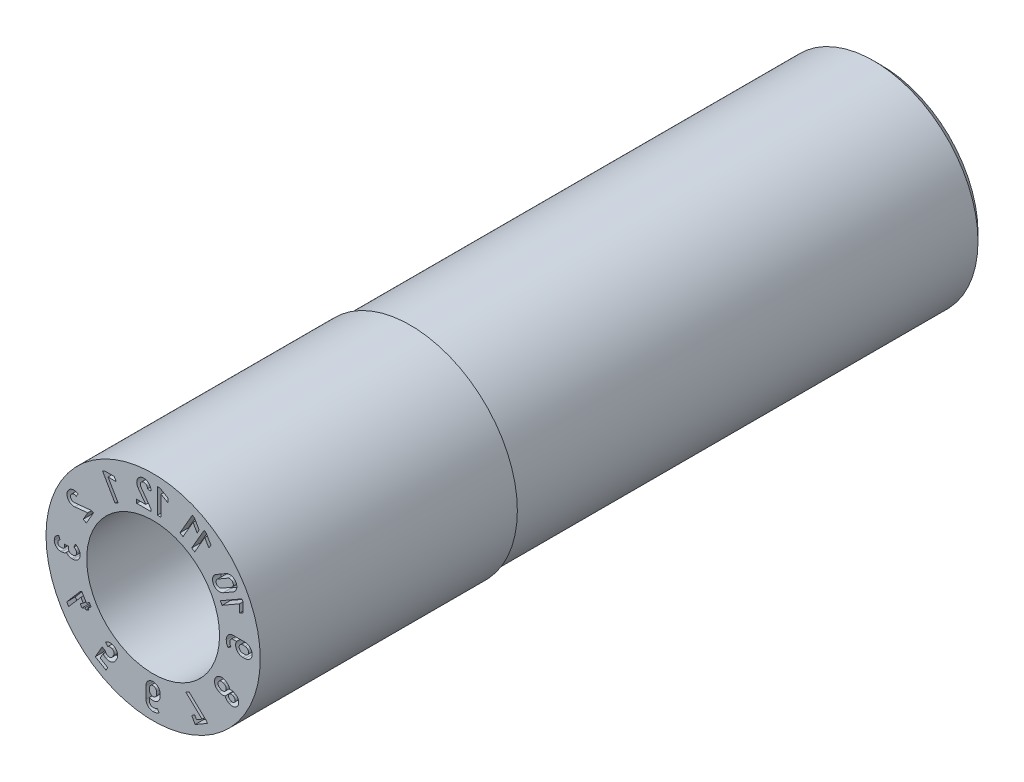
from build123d import *

# Parameters (mm, degrees)
SKETCH4_W          = 11
SKETCH4_H          = 1
CUT_EXTRUDE1_DEPTH = 0.2
CUT_EXTRUDE2_DEPTH = 1.4


with BuildPart() as part:
    # Sketch1 → Revolve1 (revolve)
    with BuildSketch(Plane(origin=(0, 0, 0), x_dir=(0, 0, -1), z_dir=(1, 0, 0)), mode=Mode.PRIVATE) as revolve1_sk:
        Polygon((0, 2.5), (0, 1.55), (2.8, 1.55), (2.8, 0.8), (14, 0.8), (14, 1.5), (17, 1.5), (17, 2.25), (16.75, 2.5), align=None)
    revolve(revolve1_sk.sketch.rotate(Axis((0, 0, 3.797909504), (0, 0, -1)), 90), axis=Axis((0, 0, 3.797909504), (0, 0, -1)))

    # Sketch4 → Cut-Revolve1 (revolve, cut)
    with BuildSketch(Plane(origin=(0, 0, 0), x_dir=(0, 0, -1), z_dir=(1, 0, 0)), mode=Mode.PRIVATE) as cut_revolve1_sk:
        with Locations((11.5, 2.935)):
            Rectangle(SKETCH4_W, SKETCH4_H)
    revolve(cut_revolve1_sk.sketch.rotate(Axis((0, 0, 0), (0, 0, -1)), 90), axis=Axis((0, 0, 0), (0, 0, -1)), mode=Mode.SUBTRACT)

    # Sketch2 → Cut-Extrude1 (cut)
    # profile 1 of 15: a face of its own
    with BuildSketch(Plane.XY):
        Polygon((1.189785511, 1.946416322), (1.236985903, 1.919165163), (1.349145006, 1.725678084), (1.30140042, 1.642982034), (1.205586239, 1.80821378), (0.97169688, 1.403105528), (0.900002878, 1.444498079), align=None)
    # profile 2 of 15: a face of its own
    with BuildSketch(Plane.XY):
        Polygon((0.915385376, 2.116117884), (0.962585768, 2.088866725), (1.074744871, 1.895379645), (1.027000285, 1.812683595), (0.931186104, 1.977915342), (0.697296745, 1.572807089), (0.625602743, 1.61419964), align=None)
    # profile 3 of 15: a face of its own
    with BuildSketch(Plane.XY):
        with BuildLine():
            Line((2.144767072, 0.163392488), (1.871541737, 0.163346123))
            ThreePointArc((1.871541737, 0.163346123), (1.754462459, 0.114843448), (1.705943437, -0.002229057))
            ThreePointArc((1.705943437, -0.002229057), (1.715873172, -0.075274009), (1.744983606, -0.142999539))
            Line((1.744983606, -0.142999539), (1.816077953, -0.100273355))
            ThreePointArc((1.816077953, -0.100273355), (1.793827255, -0.050339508), (1.7889851, 0.004112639))
            ThreePointArc((1.7889851, 0.004112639), (1.815273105, 0.058513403), (1.871527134, 0.080558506))
            Line((1.871527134, 0.080558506), (1.947523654, 0.080551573))
            ThreePointArc((1.947523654, 0.080551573), (1.94718892, -0.085293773), (2.090950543, -0.167982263))
            Line((2.090950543, -0.167982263), (2.144654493, -0.167796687))
            ThreePointArc((2.144654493, -0.167796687), (2.31030537, -0.002258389), (2.144767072, 0.163392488))
        make_face()
        with BuildLine():
            Line((2.144767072, 0.080561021), (2.090960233, 0.080561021))
            ThreePointArc((2.090960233, 0.080561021), (2.00816354, -0.002238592), (2.090966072, -0.085032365))
            Line((2.090966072, -0.085032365), (2.144761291, -0.085032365))
            ThreePointArc((2.144761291, -0.085032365), (2.227560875, -0.002238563), (2.144767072, 0.080561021))
        make_face(mode=Mode.SUBTRACT)
    # profile 4 of 15: a face of its own
    with BuildSketch(Plane.XY):
        Polygon((0.763515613, -1.538242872), (0.838361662, -1.495030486), (1.248532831, -1.881560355), (1.268400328, -1.91597187), (0.981584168, -2.081565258), (0.898787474, -1.938157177), (0.970501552, -1.896753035), (1.011894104, -1.968447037), (1.140947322, -1.893938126), align=None)
    # profile 5 of 15: a face of its own
    with BuildSketch(Plane.XY):
        with BuildLine():
            Line((1.705307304, -0.85661671), (1.680233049, -0.842113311))
            ThreePointArc((1.680233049, -0.842113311), (1.45391345, -0.902658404), (1.514639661, -1.128929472))
            Line((1.514639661, -1.128929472), (1.539717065, -1.143407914))
            ThreePointArc((1.539717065, -1.143407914), (1.608311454, -1.164983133), (1.679583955, -1.155448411))
            ThreePointArc((1.679583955, -1.155448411), (1.705355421, -1.207044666), (1.748767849, -1.24501443))
            Line((1.748767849, -1.24501443), (1.773870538, -1.259483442))
            ThreePointArc((1.773870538, -1.259483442), (1.977393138, -1.20494098), (1.922850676, -1.00141838))
            Line((1.922850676, -1.00141838), (1.897809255, -0.986853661))
            ThreePointArc((1.897809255, -0.986853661), (1.843247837, -0.968135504), (1.785676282, -0.971717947))
            ThreePointArc((1.785676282, -0.971717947), (1.758292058, -0.905229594), (1.705307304, -0.85661671))
        make_face()
        with BuildLine():
            Line((1.790155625, -1.173326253), (1.81525798, -1.187792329))
            ThreePointArc((1.81525798, -1.187792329), (1.905733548, -1.163549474), (1.881490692, -1.073073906))
            Line((1.881490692, -1.073073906), (1.856411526, -1.058567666))
            ThreePointArc((1.856411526, -1.058567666), (1.765812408, -1.082765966), (1.790155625, -1.173326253))
        make_face(mode=Mode.SUBTRACT)
        with BuildLine():
            Line((1.55601773, -1.057232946), (1.581132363, -1.071732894))
            ThreePointArc((1.581132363, -1.071732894), (1.694215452, -1.04141854), (1.663901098, -0.928335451))
            Line((1.663901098, -0.928335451), (1.638826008, -0.913804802))
            ThreePointArc((1.638826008, -0.913804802), (1.525737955, -0.944132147), (1.55601773, -1.057232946))
        make_face(mode=Mode.SUBTRACT)
    # profile 6 of 15: a face of its own
    with BuildSketch(Plane.XY):
        Polygon((2.071005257, 1.002372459), (2.098256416, 0.955172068), (2.098645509, 0.73152779), (2.015949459, 0.683783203), (2.015587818, 0.874785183), (1.610479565, 0.640895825), (1.569087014, 0.712589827), align=None)
    # profile 7 of 15: a face of its own
    with BuildSketch(Plane.XY):
        with BuildLine():
            Line((1.705388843, 1.33047051), (1.468770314, 1.193858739))
            ThreePointArc((1.468770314, 1.193858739), (1.408137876, 0.967618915), (1.634381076, 0.906999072))
            Line((1.634381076, 0.906999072), (1.871005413, 1.043614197))
            ThreePointArc((1.871005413, 1.043614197), (1.931625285, 1.269850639), (1.705388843, 1.33047051))
        make_face()
        with BuildLine():
            Line((1.592976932, 0.978713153), (1.829601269, 1.115328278))
            ThreePointArc((1.829601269, 1.115328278), (1.85990272, 1.228414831), (1.746816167, 1.258716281))
            Line((1.746816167, 1.258716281), (1.510163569, 1.122138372))
            ThreePointArc((1.510163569, 1.122138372), (1.4798551, 1.009017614), (1.592976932, 0.978713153))
        make_face(mode=Mode.SUBTRACT)
    # profile 8 of 15: a face of its own
    with BuildSketch(Plane.XY):
        Polygon((0.101613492, 2.286608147), (0.156115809, 2.286608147), (0.349991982, 2.175122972), (0.349991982, 2.079633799), (0.184398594, 2.174821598), (0.184398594, 1.707042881), (0.101613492, 1.707042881), align=None)
    # profile 9 of 15: a face of its own
    with BuildSketch(Plane.XY):
        with BuildLine():
            Line((-0.382458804, 1.705773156), (-0.051272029, 1.705773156))
            Line((-0.051272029, 1.705773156), (-0.051272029, 1.760530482))
            Line((-0.051272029, 1.760530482), (-0.284094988, 2.083765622))
            ThreePointArc((-0.284094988, 2.083765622), (-0.236321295, 2.212681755), (-0.135007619, 2.119745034))
            Line((-0.135007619, 2.119745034), (-0.05173191, 2.119742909))
            ThreePointArc((-0.05173191, 2.119742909), (-0.261870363, 2.291530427), (-0.35138769, 2.03529661))
            Line((-0.35138769, 2.03529661), (-0.171311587, 1.788581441))
            Line((-0.171311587, 1.788581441), (-0.382458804, 1.788581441))
            Line((-0.382458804, 1.788581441), (-0.382458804, 1.705773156))
        make_face()
    # profile 10 of 15: a face of its own
    with BuildSketch(Plane.XY):
        Polygon((-1.178901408, 1.959132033), (-1.131701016, 1.986383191), (-0.908056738, 1.986772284), (-0.860312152, 1.904076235), (-1.051314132, 1.903714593), (-0.817424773, 1.498606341), (-0.889118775, 1.457213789), align=None)
    # profile 11 of 15: a face of its own
    with BuildSketch(Plane.XY):
        with BuildLine():
            Line((0.163306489, -1.871711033), (0.163492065, -1.925414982))
            ThreePointArc((0.163492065, -1.925414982), (0.080803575, -2.069176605), (-0.085041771, -2.068841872))
            Line((-0.085041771, -2.068841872), (-0.085048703, -2.144838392))
            ThreePointArc((-0.085048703, -2.144838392), (-0.0630036, -2.201092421), (-0.008602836, -2.227380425))
            ThreePointArc((-0.008602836, -2.227380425), (0.045845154, -2.222539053), (0.09577566, -2.200291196))
            Line((0.09577566, -2.200291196), (0.138511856, -2.271391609))
            ThreePointArc((0.138511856, -2.271391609), (0.070786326, -2.300502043), (-0.002258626, -2.310431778))
            ThreePointArc((-0.002258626, -2.310431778), (-0.11933113, -2.261912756), (-0.167833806, -2.144833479))
            Line((-0.167833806, -2.144833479), (-0.167880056, -1.871597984))
            ThreePointArc((-0.167880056, -1.871597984), (-0.002230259, -1.706061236), (0.163306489, -1.871711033))
        make_face()
        with BuildLine():
            Line((-0.085048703, -1.871608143), (-0.085048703, -1.925414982))
            ThreePointArc((-0.085048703, -1.925414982), (-0.002249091, -2.008211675), (0.080544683, -1.925409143))
            Line((0.080544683, -1.925409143), (0.080544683, -1.871613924))
            ThreePointArc((0.080544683, -1.871613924), (-0.00224912, -1.788814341), (-0.085048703, -1.871608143))
        make_face(mode=Mode.SUBTRACT)
    # profile 12 of 15: a face of its own
    with BuildSketch(Plane.XY):
        with BuildLine():
            Line((-0.850418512, -1.674551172), (-0.877373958, -1.721100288))
            ThreePointArc((-0.877373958, -1.721100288), (-0.977919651, -1.798165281), (-1.103534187, -1.781750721))
            ThreePointArc((-1.103534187, -1.781750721), (-1.137985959, -1.756862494), (-1.166573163, -1.725412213))
            Line((-1.166573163, -1.725412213), (-1.237312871, -1.847914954))
            Line((-1.237312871, -1.847914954), (-1.058047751, -1.951413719))
            Line((-1.058047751, -1.951413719), (-1.099451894, -2.023127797))
            Line((-1.099451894, -2.023127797), (-1.350411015, -1.878236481))
            Line((-1.350411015, -1.878236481), (-1.189709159, -1.5998927))
            Line((-1.189709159, -1.5998927), (-1.118015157, -1.641285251))
            ThreePointArc((-1.118015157, -1.641285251), (-1.09640669, -1.680826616), (-1.062121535, -1.710066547))
            ThreePointArc((-1.062121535, -1.710066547), (-0.999297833, -1.718342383), (-0.949038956, -1.679750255))
            Line((-0.949038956, -1.679750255), (-0.922111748, -1.633157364))
            ThreePointArc((-0.922111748, -1.633157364), (-0.91382848, -1.57032602), (-0.952425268, -1.520059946))
            ThreePointArc((-0.952425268, -1.520059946), (-1.007061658, -1.507582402), (-1.059262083, -1.527977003))
            Line((-1.059262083, -1.527977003), (-1.110809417, -1.463095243))
            ThreePointArc((-1.110809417, -1.463095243), (-1.01319352, -1.424927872), (-0.91102973, -1.448340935))
            ThreePointArc((-0.91102973, -1.448340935), (-0.833919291, -1.548905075), (-0.850418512, -1.674551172))
        make_face()
    # profile 13 of 15: a face of its own
    with BuildSketch(Plane.XY):
        with BuildLine():
            Line((-2.158495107, -0.150850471), (-2.129528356, -0.150850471))
            ThreePointArc((-2.129528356, -0.150850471), (-2.072961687, -0.139692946), (-2.024868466, -0.10789168))
            ThreePointArc((-2.024868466, -0.10789168), (-1.967910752, -0.151797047), (-1.897708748, -0.16740285))
            Line((-1.897708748, -0.16740285), (-1.868719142, -0.16740285))
            ThreePointArc((-1.868719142, -0.16740285), (-1.751638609, -0.118901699), (-1.703153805, -0.001814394))
            ThreePointArc((-1.703153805, -0.001814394), (-1.734003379, 0.098332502), (-1.81583933, 0.163784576))
            Line((-1.81583933, 0.163784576), (-1.846218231, 0.08678617))
            ThreePointArc((-1.846218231, 0.08678617), (-1.802437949, 0.051774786), (-1.785938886, -0.001800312))
            ThreePointArc((-1.785938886, -0.001800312), (-1.810188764, -0.060344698), (-1.86873315, -0.084594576))
            Line((-1.86873315, -0.084594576), (-1.897712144, -0.084594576))
            ThreePointArc((-1.897712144, -0.084594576), (-1.956243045, -0.060350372), (-1.980487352, -0.001819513))
            Line((-1.980487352, -0.001819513), (-1.980487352, 0.039571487))
            Line((-1.980487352, 0.039571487), (-2.063295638, 0.039571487))
            Line((-2.063295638, 0.039571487), (-2.063295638, -0.001809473))
            ThreePointArc((-2.063295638, -0.001809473), (-2.082694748, -0.048643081), (-2.129528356, -0.068042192))
            Line((-2.129528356, -0.068042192), (-2.15850334, -0.068042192))
            ThreePointArc((-2.15850334, -0.068042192), (-2.205320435, -0.048626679), (-2.224739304, -0.001810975))
            ThreePointArc((-2.224739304, -0.001810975), (-2.210784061, 0.04164494), (-2.174084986, 0.068780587))
            Line((-2.174084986, 0.068780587), (-2.200583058, 0.147231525))
            ThreePointArc((-2.200583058, 0.147231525), (-2.278022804, 0.089913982), (-2.30753777, -0.001797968))
            ThreePointArc((-2.30753777, -0.001797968), (-2.263894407, -0.10720015), (-2.158495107, -0.150850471))
        make_face()
    # profile 14 of 15: a face of its own
    with BuildSketch(Plane.XY):
        Polygon((-2.015260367, -1.100052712), (-1.971410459, -1.17600298), (-1.685345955, -0.843537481), (-1.631712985, -0.936432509), (-1.703406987, -0.97782506), (-1.662014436, -1.049519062), (-1.590320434, -1.008126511), (-1.569618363, -1.04398355), (-1.497924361, -1.002590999), (-1.518626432, -0.96673396), (-1.446912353, -0.925329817), (-1.488304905, -0.853635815), (-1.560018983, -0.895039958), (-1.663517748, -0.715774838), (-1.70543796, -0.739977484), align=None)
    # profile 15 of 15: a face of its own
    with BuildSketch(Plane.XY):
        with BuildLine():
            Line((-1.630647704, 0.760508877), (-1.558933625, 0.719104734))
            Line((-1.558933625, 0.719104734), (-1.393340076, 1.005921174))
            Line((-1.393340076, 1.005921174), (-1.44076032, 1.033299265))
            Line((-1.44076032, 1.033299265), (-1.837101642, 0.993286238))
            ThreePointArc((-1.837101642, 0.993286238), (-1.924855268, 1.099112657), (-1.793718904, 1.140382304))
            Line((-1.793718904, 1.140382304), (-1.752081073, 1.212505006))
            ThreePointArc((-1.752081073, 1.212505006), (-2.005918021, 1.116412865), (-1.828773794, 0.910775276))
            Line((-1.828773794, 0.910775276), (-1.525074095, 0.943367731))
            Line((-1.525074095, 0.943367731), (-1.630647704, 0.760508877))
        make_face()
    extrude(amount=-CUT_EXTRUDE1_DEPTH, mode=Mode.SUBTRACT)

    # Sketch3 → Cut-Extrude2 (cut)
    with BuildSketch(Plane.XY.offset(-2.8)):
        Polygon((0.461880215, 0.8), (-0.461880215, 0.8), (-0.923760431, 0), (-0.461880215, -0.8), (0.461880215, -0.8), (0.923760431, 0), align=None)
    extrude(amount=-CUT_EXTRUDE2_DEPTH, mode=Mode.SUBTRACT)


solid = part.part
